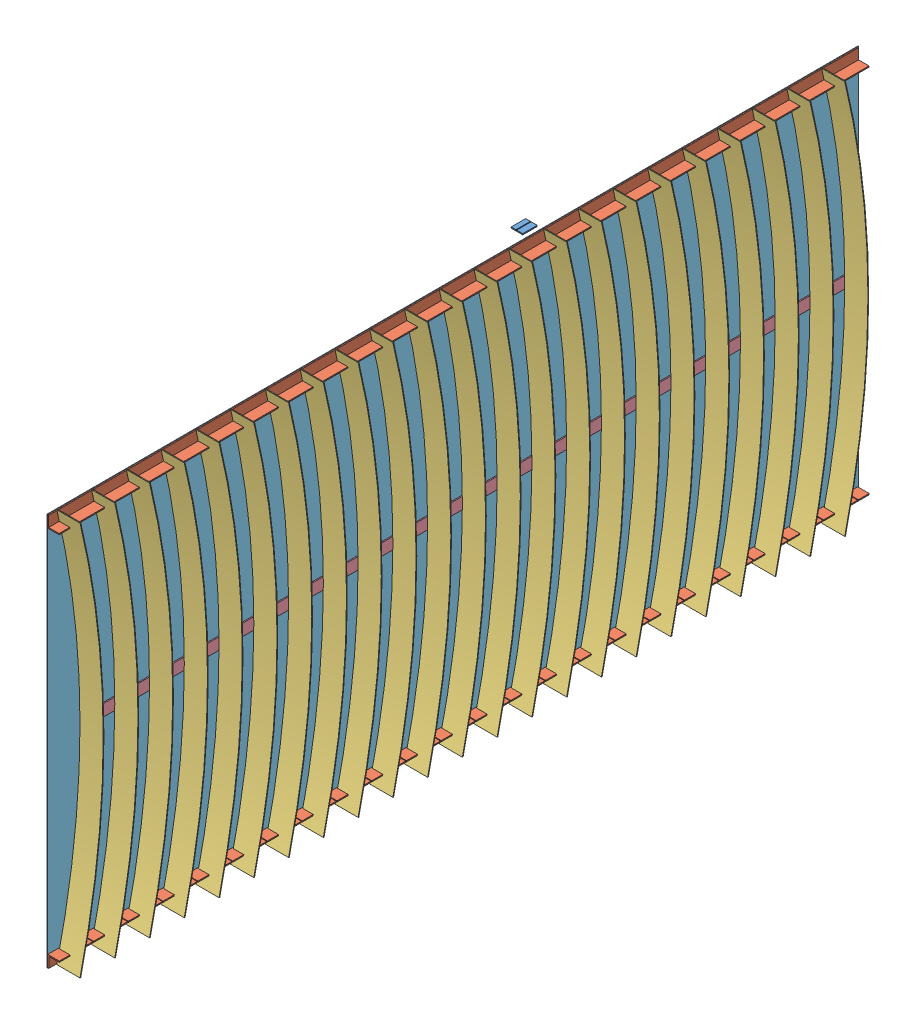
SolidWorks assembly Assem5.sldasm, configuration Default (file format 4400). Lengths in mm.
Overall size (808.94 1728.67 3556).
28 component instances, 5 part files, 11 mates.
Components (placement in the parent):
- central rib slats-1: central rib slats.SLDPRT [Default] at (-19.9608 -0.7672 -0.6907) size (50.8 4.76 63.5)
- rib angle-1: rib angle.SLDPRT [Default] at (660.0296 579.5703 -775.8506) size (50.8 50.8 3550.92)
- rib curved-1: rib curved.SLDPRT [Default] at (664.7921 633.5453 -613.9662) x (0 -1 0) z (0 0 1) size (1728.67 101.6 104.77)
- rib flatbar-1: rib flatbar.SLDPRT [Default] at (635.383 -249.0699 -780.9306) x (0 -1 0) z (0 0 1) size (50.8 4.76 3403.6)
- waterbed-1: waterbed.SLDPRT [Default] at (656.8546 597.5082 2723.2088) x (1 0 0) z (0 1 0) size (3.17 3556 1720.85)
- rib angle-2: rib angle.SLDPRT [Default] at (660.0296 -1039.6797 2774.085) x (1 0 0) z (0 0 -1) size (50.8 50.8 3550.92)
- rib curved-2: rib curved.SLDPRT [Default] at (664.7921 633.5453 -461.5662) x (0 -1 0) z (0 0 1) size (1728.67 101.6 104.77)
- rib curved-3: rib curved.SLDPRT [Default] at (664.7921 633.5453 -309.1662) x (0 -1 0) z (0 0 1) size (1728.67 101.6 104.77)
- rib curved-4: rib curved.SLDPRT [Default] at (664.7921 633.5453 -156.7662) x (0 -1 0) z (0 0 1) size (1728.67 101.6 104.77)
- rib curved-5: rib curved.SLDPRT [Default] at (664.7921 633.5453 -4.3662) x (0 -1 0) z (0 0 1) size (1728.67 101.6 104.77)
- rib curved-6: rib curved.SLDPRT [Default] at (664.7921 633.5453 148.0338) x (0 -1 0) z (0 0 1) size (1728.67 101.6 104.77)
- rib curved-7: rib curved.SLDPRT [Default] at (664.7921 633.5453 300.4338) x (0 -1 0) z (0 0 1) size (1728.67 101.6 104.77)
- rib curved-8: rib curved.SLDPRT [Default] at (664.7921 633.5453 452.8338) x (0 -1 0) z (0 0 1) size (1728.67 101.6 104.77)
- rib curved-9: rib curved.SLDPRT [Default] at (664.7921 633.5453 605.2338) x (0 -1 0) z (0 0 1) size (1728.67 101.6 104.77)
- rib curved-10: rib curved.SLDPRT [Default] at (664.7921 633.5453 757.6338) x (0 -1 0) z (0 0 1) size (1728.67 101.6 104.77)
- rib curved-11: rib curved.SLDPRT [Default] at (664.7921 633.5453 910.0338) x (0 -1 0) z (0 0 1) size (1728.67 101.6 104.77)
- rib curved-12: rib curved.SLDPRT [Default] at (664.7921 633.5453 1062.4338) x (0 -1 0) z (0 0 1) size (1728.67 101.6 104.77)
- rib curved-13: rib curved.SLDPRT [Default] at (664.7921 633.5453 1214.8338) x (0 -1 0) z (0 0 1) size (1728.67 101.6 104.77)
- rib curved-14: rib curved.SLDPRT [Default] at (664.7921 633.5453 1367.2338) x (0 -1 0) z (0 0 1) size (1728.67 101.6 104.77)
- rib curved-15: rib curved.SLDPRT [Default] at (664.7921 633.5453 1519.6338) x (0 -1 0) z (0 0 1) size (1728.67 101.6 104.77)
- rib curved-16: rib curved.SLDPRT [Default] at (664.7921 633.5453 1672.0338) x (0 -1 0) z (0 0 1) size (1728.67 101.6 104.77)
- rib curved-17: rib curved.SLDPRT [Default] at (664.7921 633.5453 1824.4338) x (0 -1 0) z (0 0 1) size (1728.67 101.6 104.77)
- rib curved-18: rib curved.SLDPRT [Default] at (664.7921 633.5453 1976.8338) x (0 -1 0) z (0 0 1) size (1728.67 101.6 104.77)
- rib curved-19: rib curved.SLDPRT [Default] at (664.7921 633.5453 2129.2338) x (0 -1 0) z (0 0 1) size (1728.67 101.6 104.77)
- rib curved-20: rib curved.SLDPRT [Default] at (664.7921 633.5453 2281.6338) x (0 -1 0) z (0 0 1) size (1728.67 101.6 104.77)
- rib curved-21: rib curved.SLDPRT [Default] at (664.7921 633.5453 2434.0338) x (0 -1 0) z (0 0 1) size (1728.67 101.6 104.77)
- rib curved-22: rib curved.SLDPRT [Default] at (664.7921 633.5453 2586.4338) x (0 -1 0) z (0 0 1) size (1728.67 101.6 104.77)
- rib curved-23: rib curved.SLDPRT [Default] at (664.7921 633.5453 2738.8338) x (0 -1 0) z (0 0 1) size (1728.67 101.6 104.77)
Mates (geometry in assembly coordinates):
- Coincident1: coincident aligned: plane of rib angle-1 through (664.7921 630.3703 2775.0694) normal (0 1 0); plane of waterbed-1 through (656.8546 630.3703 -780.9306) normal (0 1 0)
- Coincident2: coincident aligned: plane of rib angle-1 through (664.7921 579.5703 2775.0694) normal (0 0 1); plane of waterbed-1 through (656.8546 630.3703 2775.0694) normal (0 0 1)
- Coincident3: coincident anti-aligned: plane of rib angle-1 through (660.0296 630.3703 -775.8506) normal (-1 0 0); plane of waterbed-1 through (660.0296 630.3703 -780.9306) normal (1 0 0)
- Coincident4: coincident: moEndPointRef_w of rib flatbar-1; moEndPointRef_w of waterbed-1
- Coincident5: coincident anti-aligned: plane of rib flatbar-1 through (660.0296 -204.6547 -780.9306) normal (-1 0 0); plane of waterbed-1 through (660.0296 630.3703 -780.9306) normal (1 0 0)
- Parallel1: parallel aligned: plane of rib flatbar-1 through (664.7921 -255.4547 -780.9306) normal (0 -1 0); plane of waterbed-1 through (656.8546 -1090.4797 2775.0694) normal (0 -1 0)
- Coincident7: coincident anti-aligned: plane of rib angle-1 through (664.7921 630.3703 -775.8506) normal (1 0 0); plane of rib curved-1 through (664.7921 633.5453 -613.9662) normal (-1 0 0)
- Coincident8: coincident: moEndPointRef_w of rib curved-1; plane of assembly
- Coincident9: coincident: moEndPointRef_w of rib curved-1; plane of assembly
- Coincident14: coincident: line of rib angle-1 through (710.8296 584.3328 -625.3556) axis (-1 0 0); cylinder of rib curved-1 through (766.3921 -230.0547 3005.5338) axis (-1 0 0) radius 3721.1
- PLANE1: unknown: unknown of waterbed-1; unknown of waterbed-1; unknown of waterbed-1
